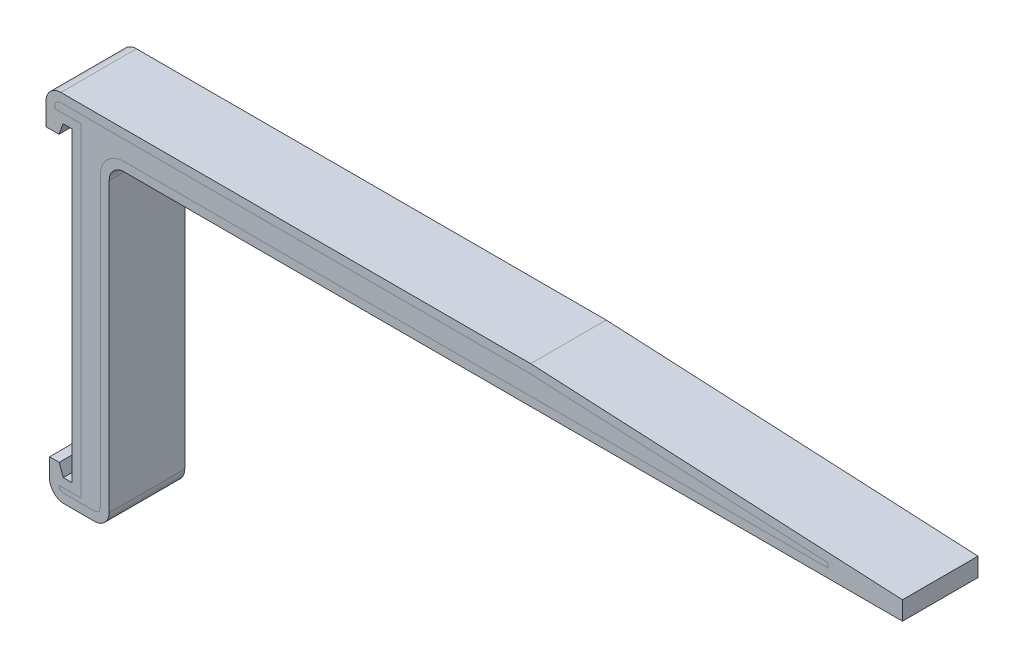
ISO-10303-21;
HEADER;
FILE_DESCRIPTION(('STEP AP214'),'2;1');
FILE_NAME('part.step','',(''),(''),'','','');
FILE_SCHEMA(('AUTOMOTIVE_DESIGN { 1 0 10303 214 1 1 1 1 }'));
ENDSEC;
DATA;
#1=APPLICATION_CONTEXT('core data for automotive mechanical design processes');
#2=APPLICATION_PROTOCOL_DEFINITION('international standard','automotive_design',2000,#1);
#3=PRODUCT_CONTEXT('',#1,'mechanical');
#4=PRODUCT('Part','Part','',(#3));
#5=PRODUCT_RELATED_PRODUCT_CATEGORY('part','',(#4));
#6=PRODUCT_DEFINITION_FORMATION('','',#4);
#7=PRODUCT_DEFINITION_CONTEXT('part definition',#1,'design');
#8=PRODUCT_DEFINITION('design','',#6,#7);
#9=PRODUCT_DEFINITION_SHAPE('','',#8);
#10=(LENGTH_UNIT() NAMED_UNIT(*) SI_UNIT(.MILLI.,.METRE.));
#11=(NAMED_UNIT(*) PLANE_ANGLE_UNIT() SI_UNIT($,.RADIAN.));
#12=(NAMED_UNIT(*) SI_UNIT($,.STERADIAN.) SOLID_ANGLE_UNIT());
#13=UNCERTAINTY_MEASURE_WITH_UNIT(LENGTH_MEASURE(1.E-05),#10,'distance_accuracy_value','');
#14=(GEOMETRIC_REPRESENTATION_CONTEXT(3) GLOBAL_UNCERTAINTY_ASSIGNED_CONTEXT((#13)) GLOBAL_UNIT_ASSIGNED_CONTEXT((#10,
#11,#12)) REPRESENTATION_CONTEXT('',''));
#15=CARTESIAN_POINT('',(0.,0.,0.));
#16=DIRECTION('',(0.,0.,1.));
#17=DIRECTION('',(1.,0.,0.));
#18=AXIS2_PLACEMENT_3D('',#15,#16,#17);
#19=CARTESIAN_POINT('',(0.,0.,-50.8));
#20=DIRECTION('',(0.,0.,1.));
#21=DIRECTION('',(1.,0.,0.));
#22=AXIS2_PLACEMENT_3D('',#19,#20,#21);
#23=PLANE('',#22);
#24=DIRECTION('',(0.,-1.,0.));
#25=VECTOR('',#24,1.);
#26=CARTESIAN_POINT('',(99.55,-8062.375,-50.8));
#27=LINE('',#26,#25);
#28=CARTESIAN_POINT('',(99.55,-8032.375,-50.8));
#29=VERTEX_POINT('',#28);
#30=CARTESIAN_POINT('',(99.55,-8062.375,-50.8));
#31=VERTEX_POINT('',#30);
#32=EDGE_CURVE('E404',#29,#31,#27,.T.);
#33=ORIENTED_EDGE('',*,*,#32,.F.);
#34=CARTESIAN_POINT('',(119.55,-8032.375,-50.8));
#35=DIRECTION('',(0.,0.,1.));
#36=DIRECTION('',(1.,0.,0.));
#37=AXIS2_PLACEMENT_3D('',#34,#35,#36);
#38=CIRCLE('',#37,20.);
#39=CARTESIAN_POINT('',(119.55,-8012.375,-50.8));
#40=VERTEX_POINT('',#39);
#41=EDGE_CURVE('E527',#29,#40,#38,.F.);
#42=ORIENTED_EDGE('',*,*,#41,.T.);
#43=DIRECTION('',(-1.,0.,0.));
#44=VECTOR('',#43,1.);
#45=CARTESIAN_POINT('',(99.55,-8012.375,-50.8));
#46=LINE('',#45,#44);
#47=CARTESIAN_POINT('',(751.35,-8012.375,-50.8));
#48=VERTEX_POINT('',#47);
#49=EDGE_CURVE('E401',#48,#40,#46,.T.);
#50=ORIENTED_EDGE('',*,*,#49,.F.);
#51=DIRECTION('',(-0.998752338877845,0.0499376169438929,0.));
#52=VECTOR('',#51,1.);
#53=CARTESIAN_POINT('',(1251.35,-8037.375,-50.8));
#54=LINE('',#53,#52);
#55=CARTESIAN_POINT('',(1251.35,-8037.375,-50.8));
#56=VERTEX_POINT('',#55);
#57=EDGE_CURVE('E398',#56,#48,#54,.T.);
#58=ORIENTED_EDGE('',*,*,#57,.F.);
#59=DIRECTION('',(0.,1.,0.));
#60=VECTOR('',#59,1.);
#61=CARTESIAN_POINT('',(1251.35,-8062.375,-50.8));
#62=LINE('',#61,#60);
#63=CARTESIAN_POINT('',(1251.35,-8062.375,-50.8));
#64=VERTEX_POINT('',#63);
#65=EDGE_CURVE('E393',#64,#56,#62,.T.);
#66=ORIENTED_EDGE('',*,*,#65,.F.);
#67=DIRECTION('',(1.,0.,0.));
#68=VECTOR('',#67,1.);
#69=CARTESIAN_POINT('',(184.55,-8062.375,-50.8));
#70=LINE('',#69,#68);
#71=CARTESIAN_POINT('',(1098.95,-8062.375,-50.8));
#72=VERTEX_POINT('',#71);
#73=EDGE_CURVE('E390',#72,#64,#70,.T.);
#74=ORIENTED_EDGE('',*,*,#73,.F.);
#75=CARTESIAN_POINT('',(794.15,-8062.375,-50.8));
#76=VERTEX_POINT('',#75);
#77=EDGE_CURVE('E395',#76,#72,#70,.T.);
#78=ORIENTED_EDGE('',*,*,#77,.F.);
#79=CARTESIAN_POINT('',(489.35,-8062.375,-50.8));
#80=VERTEX_POINT('',#79);
#81=EDGE_CURVE('E394',#80,#76,#70,.T.);
#82=ORIENTED_EDGE('',*,*,#81,.F.);
#83=CARTESIAN_POINT('',(204.55,-8062.375,-50.8));
#84=VERTEX_POINT('',#83);
#85=EDGE_CURVE('E391',#84,#80,#70,.T.);
#86=ORIENTED_EDGE('',*,*,#85,.F.);
#87=CARTESIAN_POINT('',(204.55,-8082.375,-50.8));
#88=DIRECTION('',(0.,0.,1.));
#89=DIRECTION('',(1.,0.,0.));
#90=AXIS2_PLACEMENT_3D('',#87,#88,#89);
#91=CIRCLE('',#90,20.);
#92=CARTESIAN_POINT('',(184.55,-8082.375,-50.8));
#93=VERTEX_POINT('',#92);
#94=EDGE_CURVE('E539',#84,#93,#91,.T.);
#95=ORIENTED_EDGE('',*,*,#94,.T.);
#96=DIRECTION('',(0.,1.,0.));
#97=VECTOR('',#96,1.);
#98=CARTESIAN_POINT('',(184.55,-8489.375,-50.8));
#99=LINE('',#98,#97);
#100=CARTESIAN_POINT('',(184.55,-8469.375,-50.8));
#101=VERTEX_POINT('',#100);
#102=EDGE_CURVE('E387',#101,#93,#99,.T.);
#103=ORIENTED_EDGE('',*,*,#102,.F.);
#104=CARTESIAN_POINT('',(164.55,-8469.375,-50.8));
#105=DIRECTION('',(0.,0.,1.));
#106=DIRECTION('',(1.,0.,0.));
#107=AXIS2_PLACEMENT_3D('',#104,#105,#106);
#108=CIRCLE('',#107,20.);
#109=CARTESIAN_POINT('',(164.55,-8489.375,-50.8));
#110=VERTEX_POINT('',#109);
#111=EDGE_CURVE('E523',#101,#110,#108,.F.);
#112=ORIENTED_EDGE('',*,*,#111,.T.);
#113=DIRECTION('',(1.,0.,0.));
#114=VECTOR('',#113,1.);
#115=CARTESIAN_POINT('',(104.3,-8489.375,-50.8));
#116=LINE('',#115,#114);
#117=CARTESIAN_POINT('',(124.3,-8489.375,-50.8));
#118=VERTEX_POINT('',#117);
#119=EDGE_CURVE('E383',#118,#110,#116,.T.);
#120=ORIENTED_EDGE('',*,*,#119,.F.);
#121=CARTESIAN_POINT('',(124.3,-8469.375,-50.8));
#122=DIRECTION('',(0.,0.,1.));
#123=DIRECTION('',(1.,0.,0.));
#124=AXIS2_PLACEMENT_3D('',#121,#122,#123);
#125=CIRCLE('',#124,20.);
#126=CARTESIAN_POINT('',(104.3,-8469.375,-50.8));
#127=VERTEX_POINT('',#126);
#128=EDGE_CURVE('E525',#118,#127,#125,.F.);
#129=ORIENTED_EDGE('',*,*,#128,.T.);
#130=DIRECTION('',(0.,-1.,0.));
#131=VECTOR('',#130,1.);
#132=CARTESIAN_POINT('',(104.3,-8444.375,-50.8));
#133=LINE('',#132,#131);
#134=CARTESIAN_POINT('',(104.3,-8444.375,-50.8));
#135=VERTEX_POINT('',#134);
#136=EDGE_CURVE('E380',#135,#127,#133,.T.);
#137=ORIENTED_EDGE('',*,*,#136,.F.);
#138=DIRECTION('',(-1.,0.,0.));
#139=VECTOR('',#138,1.);
#140=CARTESIAN_POINT('',(117.3,-8444.375,-50.8));
#141=LINE('',#140,#139);
#142=CARTESIAN_POINT('',(117.3,-8444.375,-50.8));
#143=VERTEX_POINT('',#142);
#144=EDGE_CURVE('E424',#143,#135,#141,.T.);
#145=ORIENTED_EDGE('',*,*,#144,.F.);
#146=DIRECTION('',(-0.34202014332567,0.939692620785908,0.));
#147=VECTOR('',#146,1.);
#148=CARTESIAN_POINT('',(122.759553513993,-8459.375,-50.8));
#149=LINE('',#148,#147);
#150=CARTESIAN_POINT('',(122.759553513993,-8459.375,-50.8));
#151=VERTEX_POINT('',#150);
#152=EDGE_CURVE('E421',#151,#143,#149,.T.);
#153=ORIENTED_EDGE('',*,*,#152,.F.);
#154=DIRECTION('',(-1.,0.,0.));
#155=VECTOR('',#154,1.);
#156=CARTESIAN_POINT('',(134.55,-8459.375,-50.8));
#157=LINE('',#156,#155);
#158=CARTESIAN_POINT('',(134.55,-8459.375,-50.8));
#159=VERTEX_POINT('',#158);
#160=EDGE_CURVE('E418',#159,#151,#157,.T.);
#161=ORIENTED_EDGE('',*,*,#160,.F.);
#162=DIRECTION('',(0.,-1.,0.));
#163=VECTOR('',#162,1.);
#164=CARTESIAN_POINT('',(134.55,-8459.375,-50.8));
#165=LINE('',#164,#163);
#166=CARTESIAN_POINT('',(134.55,-8337.96903939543,-50.8));
#167=VERTEX_POINT('',#166);
#168=EDGE_CURVE('E349',#167,#159,#165,.T.);
#169=ORIENTED_EDGE('',*,*,#168,.F.);
#170=CARTESIAN_POINT('',(134.55,-8157.34055453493,-50.8));
#171=VERTEX_POINT('',#170);
#172=EDGE_CURVE('E419',#171,#167,#165,.T.);
#173=ORIENTED_EDGE('',*,*,#172,.F.);
#174=CARTESIAN_POINT('',(134.55,-8047.375,-50.8));
#175=VERTEX_POINT('',#174);
#176=EDGE_CURVE('E415',#175,#171,#165,.T.);
#177=ORIENTED_EDGE('',*,*,#176,.F.);
#178=DIRECTION('',(1.,0.,0.));
#179=VECTOR('',#178,1.);
#180=CARTESIAN_POINT('',(122.509553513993,-8047.375,-50.8));
#181=LINE('',#180,#179);
#182=CARTESIAN_POINT('',(122.509553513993,-8047.375,-50.8));
#183=VERTEX_POINT('',#182);
#184=EDGE_CURVE('E412',#183,#175,#181,.T.);
#185=ORIENTED_EDGE('',*,*,#184,.F.);
#186=DIRECTION('',(0.34202014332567,0.939692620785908,0.));
#187=VECTOR('',#186,1.);
#188=CARTESIAN_POINT('',(117.05,-8062.375,-50.8));
#189=LINE('',#188,#187);
#190=CARTESIAN_POINT('',(117.05,-8062.375,-50.8));
#191=VERTEX_POINT('',#190);
#192=EDGE_CURVE('E409',#191,#183,#189,.T.);
#193=ORIENTED_EDGE('',*,*,#192,.F.);
#194=DIRECTION('',(1.,0.,0.));
#195=VECTOR('',#194,1.);
#196=CARTESIAN_POINT('',(117.05,-8062.375,-50.8));
#197=LINE('',#196,#195);
#198=EDGE_CURVE('E406',#31,#191,#197,.T.);
#199=ORIENTED_EDGE('',*,*,#198,.F.);
#200=EDGE_LOOP('',(#33,#42,#50,#58,#66,#74,#78,#82,#86,#95,#103,#112,#120,#129,#137,#145,#153,
#161,#169,#173,#177,#185,#193,#199));
#201=FACE_BOUND('',#200,.T.);
#202=DIRECTION('',(-1.,0.,0.));
#203=VECTOR('',#202,1.);
#204=CARTESIAN_POINT('',(0.,-8050.375,-50.8));
#205=LINE('',#204,#203);
#206=CARTESIAN_POINT('',(1151.05018726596,-8050.375,-50.8));
#207=VERTEX_POINT('',#206);
#208=CARTESIAN_POINT('',(1098.95,-8050.375,-50.8));
#209=VERTEX_POINT('',#208);
#210=EDGE_CURVE('E11',#207,#209,#205,.T.);
#211=ORIENTED_EDGE('',*,*,#210,.F.);
#212=DIRECTION('',(5.73615229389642E-12,-1.,0.));
#213=VECTOR('',#212,1.);
#214=CARTESIAN_POINT('',(1151.05018721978,6.60259917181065E-09,-50.8));
#215=LINE('',#214,#213);
#216=CARTESIAN_POINT('',(1151.05018726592,-8044.375,-50.8));
#217=VERTEX_POINT('',#216);
#218=EDGE_CURVE('E49',#217,#207,#215,.T.);
#219=ORIENTED_EDGE('',*,*,#218,.F.);
#220=DIRECTION('',(0.998752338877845,-0.0499376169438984,0.));
#221=VECTOR('',#220,1.);
#222=CARTESIAN_POINT('',(-398.345261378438,-7966.90522756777,-50.8));
#223=LINE('',#222,#221);
#224=CARTESIAN_POINT('',(751.050187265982,-8024.375,-50.8));
#225=VERTEX_POINT('',#224);
#226=EDGE_CURVE('E628',#225,#217,#223,.T.);
#227=ORIENTED_EDGE('',*,*,#226,.F.);
#228=DIRECTION('',(1.,0.,0.));
#229=VECTOR('',#228,1.);
#230=CARTESIAN_POINT('',(0.,-8024.375,-50.8));
#231=LINE('',#230,#229);
#232=CARTESIAN_POINT('',(119.55,-8024.375,-50.8));
#233=VERTEX_POINT('',#232);
#234=EDGE_CURVE('E631',#233,#225,#231,.T.);
#235=ORIENTED_EDGE('',*,*,#234,.F.);
#236=CARTESIAN_POINT('',(119.55,-8032.375,-50.8));
#237=DIRECTION('',(0.,0.,1.));
#238=DIRECTION('',(1.,0.,0.));
#239=AXIS2_PLACEMENT_3D('',#236,#237,#238);
#240=CIRCLE('',#239,7.99999999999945);
#241=CARTESIAN_POINT('',(111.55,-8032.375,-50.8));
#242=VERTEX_POINT('',#241);
#243=EDGE_CURVE('E635',#242,#233,#240,.F.);
#244=ORIENTED_EDGE('',*,*,#243,.F.);
#245=DIRECTION('',(0.,1.,0.));
#246=VECTOR('',#245,1.);
#247=CARTESIAN_POINT('',(111.55,0.,-50.8));
#248=LINE('',#247,#246);
#249=CARTESIAN_POINT('',(111.55,-8035.375,-50.8));
#250=VERTEX_POINT('',#249);
#251=EDGE_CURVE('E639',#250,#242,#248,.T.);
#252=ORIENTED_EDGE('',*,*,#251,.F.);
#253=DIRECTION('',(-1.,0.,0.));
#254=VECTOR('',#253,1.);
#255=CARTESIAN_POINT('',(0.,-8035.375,-50.8));
#256=LINE('',#255,#254);
#257=CARTESIAN_POINT('',(114.107063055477,-8035.375,-50.8));
#258=VERTEX_POINT('',#257);
#259=EDGE_CURVE('E643',#258,#250,#256,.T.);
#260=ORIENTED_EDGE('',*,*,#259,.F.);
#261=DIRECTION('',(-1.,0.,0.));
#262=VECTOR('',#261,1.);
#263=CARTESIAN_POINT('',(0.,-8035.375,-50.8));
#264=LINE('',#263,#262);
#265=CARTESIAN_POINT('',(146.55,-8035.375,-50.8));
#266=VERTEX_POINT('',#265);
#267=EDGE_CURVE('E647',#266,#258,#264,.T.);
#268=ORIENTED_EDGE('',*,*,#267,.F.);
#269=DIRECTION('',(0.,1.,0.));
#270=VECTOR('',#269,1.);
#271=CARTESIAN_POINT('',(146.55,0.,-50.8));
#272=LINE('',#271,#270);
#273=CARTESIAN_POINT('',(146.55,-8157.34055453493,-50.8));
#274=VERTEX_POINT('',#273);
#275=EDGE_CURVE('E651',#274,#266,#272,.T.);
#276=ORIENTED_EDGE('',*,*,#275,.F.);
#277=DIRECTION('',(0.,1.,0.));
#278=VECTOR('',#277,1.);
#279=CARTESIAN_POINT('',(146.55,0.,-50.8));
#280=LINE('',#279,#278);
#281=CARTESIAN_POINT('',(146.55,-8337.96903939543,-50.8));
#282=VERTEX_POINT('',#281);
#283=EDGE_CURVE('E655',#282,#274,#280,.T.);
#284=ORIENTED_EDGE('',*,*,#283,.F.);
#285=DIRECTION('',(0.,1.,0.));
#286=VECTOR('',#285,1.);
#287=CARTESIAN_POINT('',(146.55,0.,-50.8));
#288=LINE('',#287,#286);
#289=CARTESIAN_POINT('',(146.55,-8471.375,-50.8));
#290=VERTEX_POINT('',#289);
#291=EDGE_CURVE('E659',#290,#282,#288,.T.);
#292=ORIENTED_EDGE('',*,*,#291,.F.);
#293=DIRECTION('',(1.,0.,0.));
#294=VECTOR('',#293,1.);
#295=CARTESIAN_POINT('',(0.,-8471.375,-50.8));
#296=LINE('',#295,#294);
#297=CARTESIAN_POINT('',(116.554033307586,-8471.375,-50.8));
#298=VERTEX_POINT('',#297);
#299=EDGE_CURVE('E663',#298,#290,#296,.T.);
#300=ORIENTED_EDGE('',*,*,#299,.F.);
#301=CARTESIAN_POINT('',(124.3,-8469.375,-50.8));
#302=DIRECTION('',(0.,0.,1.));
#303=DIRECTION('',(1.,0.,0.));
#304=AXIS2_PLACEMENT_3D('',#301,#302,#303);
#305=CIRCLE('',#304,7.99999999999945);
#306=CARTESIAN_POINT('',(124.3,-8477.375,-50.8));
#307=VERTEX_POINT('',#306);
#308=EDGE_CURVE('E667',#307,#298,#305,.F.);
#309=ORIENTED_EDGE('',*,*,#308,.F.);
#310=DIRECTION('',(-1.,0.,0.));
#311=VECTOR('',#310,1.);
#312=CARTESIAN_POINT('',(0.,-8477.375,-50.8));
#313=LINE('',#312,#311);
#314=CARTESIAN_POINT('',(164.55,-8477.375,-50.8));
#315=VERTEX_POINT('',#314);
#316=EDGE_CURVE('E671',#315,#307,#313,.T.);
#317=ORIENTED_EDGE('',*,*,#316,.F.);
#318=CARTESIAN_POINT('',(164.55,-8469.375,-50.8));
#319=DIRECTION('',(0.,0.,1.));
#320=DIRECTION('',(1.,0.,0.));
#321=AXIS2_PLACEMENT_3D('',#318,#319,#320);
#322=CIRCLE('',#321,7.99999999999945);
#323=CARTESIAN_POINT('',(172.55,-8469.375,-50.8));
#324=VERTEX_POINT('',#323);
#325=EDGE_CURVE('E675',#324,#315,#322,.F.);
#326=ORIENTED_EDGE('',*,*,#325,.F.);
#327=DIRECTION('',(0.,-1.,0.));
#328=VECTOR('',#327,1.);
#329=CARTESIAN_POINT('',(172.550000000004,0.,-50.8));
#330=LINE('',#329,#328);
#331=CARTESIAN_POINT('',(172.55,-8082.375,-50.8));
#332=VERTEX_POINT('',#331);
#333=EDGE_CURVE('E679',#332,#324,#330,.T.);
#334=ORIENTED_EDGE('',*,*,#333,.F.);
#335=CARTESIAN_POINT('',(204.55,-8082.375,-50.8));
#336=DIRECTION('',(0.,0.,1.));
#337=DIRECTION('',(1.,0.,0.));
#338=AXIS2_PLACEMENT_3D('',#335,#336,#337);
#339=CIRCLE('',#338,32.);
#340=CARTESIAN_POINT('',(204.55,-8050.375,-50.8));
#341=VERTEX_POINT('',#340);
#342=EDGE_CURVE('E683',#341,#332,#339,.T.);
#343=ORIENTED_EDGE('',*,*,#342,.F.);
#344=DIRECTION('',(-1.,0.,0.));
#345=VECTOR('',#344,1.);
#346=CARTESIAN_POINT('',(0.,-8050.375,-50.8));
#347=LINE('',#346,#345);
#348=CARTESIAN_POINT('',(489.35,-8050.375,-50.8));
#349=VERTEX_POINT('',#348);
#350=EDGE_CURVE('E687',#349,#341,#347,.T.);
#351=ORIENTED_EDGE('',*,*,#350,.F.);
#352=DIRECTION('',(-1.,0.,0.));
#353=VECTOR('',#352,1.);
#354=CARTESIAN_POINT('',(0.,-8050.375,-50.8));
#355=LINE('',#354,#353);
#356=CARTESIAN_POINT('',(794.15,-8050.375,-50.8));
#357=VERTEX_POINT('',#356);
#358=EDGE_CURVE('E690',#357,#349,#355,.T.);
#359=ORIENTED_EDGE('',*,*,#358,.F.);
#360=DIRECTION('',(-1.,0.,0.));
#361=VECTOR('',#360,1.);
#362=CARTESIAN_POINT('',(0.,-8050.375,-50.8));
#363=LINE('',#362,#361);
#364=EDGE_CURVE('E43',#209,#357,#363,.T.);
#365=ORIENTED_EDGE('',*,*,#364,.F.);
#366=EDGE_LOOP('',(#211,#219,#227,#235,#244,#252,#260,#268,#276,#284,#292,#300,#309,#317,#326,
#334,#343,#351,#359,#365));
#367=FACE_BOUND('',#366,.T.);
#368=ADVANCED_FACE('F39',(#201,#367),#23,.F.);
#369=CARTESIAN_POINT('',(0.,0.,50.8));
#370=DIRECTION('',(0.,0.,1.));
#371=DIRECTION('',(1.,0.,0.));
#372=AXIS2_PLACEMENT_3D('',#369,#370,#371);
#373=PLANE('',#372);
#374=DIRECTION('',(-1.,0.,0.));
#375=VECTOR('',#374,1.);
#376=CARTESIAN_POINT('',(99.55,-8012.375,50.8));
#377=LINE('',#376,#375);
#378=CARTESIAN_POINT('',(751.35,-8012.375,50.8));
#379=VERTEX_POINT('',#378);
#380=CARTESIAN_POINT('',(119.55,-8012.375,50.8));
#381=VERTEX_POINT('',#380);
#382=EDGE_CURVE('E447',#379,#381,#377,.T.);
#383=ORIENTED_EDGE('',*,*,#382,.T.);
#384=CARTESIAN_POINT('',(119.55,-8032.375,50.8));
#385=DIRECTION('',(0.,0.,1.));
#386=DIRECTION('',(1.,0.,0.));
#387=AXIS2_PLACEMENT_3D('',#384,#385,#386);
#388=CIRCLE('',#387,20.);
#389=CARTESIAN_POINT('',(99.55,-8032.375,50.8));
#390=VERTEX_POINT('',#389);
#391=EDGE_CURVE('E519',#381,#390,#388,.T.);
#392=ORIENTED_EDGE('',*,*,#391,.T.);
#393=DIRECTION('',(0.,-1.,0.));
#394=VECTOR('',#393,1.);
#395=CARTESIAN_POINT('',(99.55,-8062.375,50.8));
#396=LINE('',#395,#394);
#397=CARTESIAN_POINT('',(99.55,-8062.375,50.8));
#398=VERTEX_POINT('',#397);
#399=EDGE_CURVE('E450',#390,#398,#396,.T.);
#400=ORIENTED_EDGE('',*,*,#399,.T.);
#401=DIRECTION('',(1.,0.,0.));
#402=VECTOR('',#401,1.);
#403=CARTESIAN_POINT('',(117.05,-8062.375,50.8));
#404=LINE('',#403,#402);
#405=CARTESIAN_POINT('',(117.05,-8062.375,50.8));
#406=VERTEX_POINT('',#405);
#407=EDGE_CURVE('E452',#398,#406,#404,.T.);
#408=ORIENTED_EDGE('',*,*,#407,.T.);
#409=DIRECTION('',(0.34202014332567,0.939692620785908,0.));
#410=VECTOR('',#409,1.);
#411=CARTESIAN_POINT('',(117.05,-8062.375,50.8));
#412=LINE('',#411,#410);
#413=CARTESIAN_POINT('',(122.509553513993,-8047.375,50.8));
#414=VERTEX_POINT('',#413);
#415=EDGE_CURVE('E455',#406,#414,#412,.T.);
#416=ORIENTED_EDGE('',*,*,#415,.T.);
#417=DIRECTION('',(1.,0.,0.));
#418=VECTOR('',#417,1.);
#419=CARTESIAN_POINT('',(122.509553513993,-8047.375,50.8));
#420=LINE('',#419,#418);
#421=CARTESIAN_POINT('',(134.55,-8047.375,50.8));
#422=VERTEX_POINT('',#421);
#423=EDGE_CURVE('E458',#414,#422,#420,.T.);
#424=ORIENTED_EDGE('',*,*,#423,.T.);
#425=DIRECTION('',(0.,-1.,0.));
#426=VECTOR('',#425,1.);
#427=CARTESIAN_POINT('',(134.55,-8459.375,50.8));
#428=LINE('',#427,#426);
#429=CARTESIAN_POINT('',(134.55,-8157.34055453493,50.8));
#430=VERTEX_POINT('',#429);
#431=EDGE_CURVE('E462',#422,#430,#428,.T.);
#432=ORIENTED_EDGE('',*,*,#431,.T.);
#433=CARTESIAN_POINT('',(134.55,-8337.96903939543,50.8));
#434=VERTEX_POINT('',#433);
#435=EDGE_CURVE('E466',#430,#434,#428,.T.);
#436=ORIENTED_EDGE('',*,*,#435,.T.);
#437=CARTESIAN_POINT('',(134.55,-8459.375,50.8));
#438=VERTEX_POINT('',#437);
#439=EDGE_CURVE('E461',#434,#438,#428,.T.);
#440=ORIENTED_EDGE('',*,*,#439,.T.);
#441=DIRECTION('',(-1.,0.,0.));
#442=VECTOR('',#441,1.);
#443=CARTESIAN_POINT('',(134.55,-8459.375,50.8));
#444=LINE('',#443,#442);
#445=CARTESIAN_POINT('',(122.759553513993,-8459.375,50.8));
#446=VERTEX_POINT('',#445);
#447=EDGE_CURVE('E465',#438,#446,#444,.T.);
#448=ORIENTED_EDGE('',*,*,#447,.T.);
#449=DIRECTION('',(-0.34202014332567,0.939692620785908,0.));
#450=VECTOR('',#449,1.);
#451=CARTESIAN_POINT('',(122.759553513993,-8459.375,50.8));
#452=LINE('',#451,#450);
#453=CARTESIAN_POINT('',(117.3,-8444.375,50.8));
#454=VERTEX_POINT('',#453);
#455=EDGE_CURVE('E469',#446,#454,#452,.T.);
#456=ORIENTED_EDGE('',*,*,#455,.T.);
#457=DIRECTION('',(-1.,0.,0.));
#458=VECTOR('',#457,1.);
#459=CARTESIAN_POINT('',(117.3,-8444.375,50.8));
#460=LINE('',#459,#458);
#461=CARTESIAN_POINT('',(104.3,-8444.375,50.8));
#462=VERTEX_POINT('',#461);
#463=EDGE_CURVE('E384',#454,#462,#460,.T.);
#464=ORIENTED_EDGE('',*,*,#463,.T.);
#465=DIRECTION('',(0.,-1.,0.));
#466=VECTOR('',#465,1.);
#467=CARTESIAN_POINT('',(104.3,-8444.375,50.8));
#468=LINE('',#467,#466);
#469=CARTESIAN_POINT('',(104.3,-8469.375,50.8));
#470=VERTEX_POINT('',#469);
#471=EDGE_CURVE('E379',#462,#470,#468,.T.);
#472=ORIENTED_EDGE('',*,*,#471,.T.);
#473=CARTESIAN_POINT('',(124.3,-8469.375,50.8));
#474=DIRECTION('',(0.,0.,1.));
#475=DIRECTION('',(1.,0.,0.));
#476=AXIS2_PLACEMENT_3D('',#473,#474,#475);
#477=CIRCLE('',#476,20.);
#478=CARTESIAN_POINT('',(124.3,-8489.375,50.8));
#479=VERTEX_POINT('',#478);
#480=EDGE_CURVE('E517',#470,#479,#477,.T.);
#481=ORIENTED_EDGE('',*,*,#480,.T.);
#482=DIRECTION('',(1.,0.,0.));
#483=VECTOR('',#482,1.);
#484=CARTESIAN_POINT('',(104.3,-8489.375,50.8));
#485=LINE('',#484,#483);
#486=CARTESIAN_POINT('',(164.55,-8489.375,50.8));
#487=VERTEX_POINT('',#486);
#488=EDGE_CURVE('E430',#479,#487,#485,.T.);
#489=ORIENTED_EDGE('',*,*,#488,.T.);
#490=CARTESIAN_POINT('',(164.55,-8469.375,50.8));
#491=DIRECTION('',(0.,0.,1.));
#492=DIRECTION('',(1.,0.,0.));
#493=AXIS2_PLACEMENT_3D('',#490,#491,#492);
#494=CIRCLE('',#493,20.);
#495=CARTESIAN_POINT('',(184.55,-8469.375,50.8));
#496=VERTEX_POINT('',#495);
#497=EDGE_CURVE('E515',#487,#496,#494,.T.);
#498=ORIENTED_EDGE('',*,*,#497,.T.);
#499=DIRECTION('',(0.,1.,0.));
#500=VECTOR('',#499,1.);
#501=CARTESIAN_POINT('',(184.55,-8489.375,50.8));
#502=LINE('',#501,#500);
#503=CARTESIAN_POINT('',(184.55,-8082.375,50.8));
#504=VERTEX_POINT('',#503);
#505=EDGE_CURVE('E433',#496,#504,#502,.T.);
#506=ORIENTED_EDGE('',*,*,#505,.T.);
#507=CARTESIAN_POINT('',(204.55,-8082.375,50.8));
#508=DIRECTION('',(0.,0.,1.));
#509=DIRECTION('',(1.,0.,0.));
#510=AXIS2_PLACEMENT_3D('',#507,#508,#509);
#511=CIRCLE('',#510,20.);
#512=CARTESIAN_POINT('',(204.55,-8062.375,50.8));
#513=VERTEX_POINT('',#512);
#514=EDGE_CURVE('E537',#504,#513,#511,.F.);
#515=ORIENTED_EDGE('',*,*,#514,.T.);
#516=DIRECTION('',(1.,0.,0.));
#517=VECTOR('',#516,1.);
#518=CARTESIAN_POINT('',(184.55,-8062.375,50.8));
#519=LINE('',#518,#517);
#520=CARTESIAN_POINT('',(489.35,-8062.375,50.8));
#521=VERTEX_POINT('',#520);
#522=EDGE_CURVE('E437',#513,#521,#519,.T.);
#523=ORIENTED_EDGE('',*,*,#522,.T.);
#524=CARTESIAN_POINT('',(794.15,-8062.375,50.8));
#525=VERTEX_POINT('',#524);
#526=EDGE_CURVE('E440',#521,#525,#519,.T.);
#527=ORIENTED_EDGE('',*,*,#526,.T.);
#528=CARTESIAN_POINT('',(1098.95,-8062.375,50.8));
#529=VERTEX_POINT('',#528);
#530=EDGE_CURVE('E441',#525,#529,#519,.T.);
#531=ORIENTED_EDGE('',*,*,#530,.T.);
#532=CARTESIAN_POINT('',(1251.35,-8062.375,50.8));
#533=VERTEX_POINT('',#532);
#534=EDGE_CURVE('E436',#529,#533,#519,.T.);
#535=ORIENTED_EDGE('',*,*,#534,.T.);
#536=DIRECTION('',(0.,1.,0.));
#537=VECTOR('',#536,1.);
#538=CARTESIAN_POINT('',(1251.35,-8062.375,50.8));
#539=LINE('',#538,#537);
#540=CARTESIAN_POINT('',(1251.35,-8037.375,50.8));
#541=VERTEX_POINT('',#540);
#542=EDGE_CURVE('E439',#533,#541,#539,.T.);
#543=ORIENTED_EDGE('',*,*,#542,.T.);
#544=DIRECTION('',(-0.998752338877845,0.0499376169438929,0.));
#545=VECTOR('',#544,1.);
#546=CARTESIAN_POINT('',(1251.35,-8037.375,50.8));
#547=LINE('',#546,#545);
#548=EDGE_CURVE('E444',#541,#379,#547,.T.);
#549=ORIENTED_EDGE('',*,*,#548,.T.);
#550=EDGE_LOOP('',(#383,#392,#400,#408,#416,#424,#432,#436,#440,#448,#456,#464,#472,#481,#489,
#498,#506,#515,#523,#527,#531,#535,#543,#549));
#551=FACE_BOUND('',#550,.T.);
#552=DIRECTION('',(5.73615229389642E-12,-1.,0.));
#553=VECTOR('',#552,1.);
#554=CARTESIAN_POINT('',(1151.05018721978,6.60259917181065E-09,50.8));
#555=LINE('',#554,#553);
#556=CARTESIAN_POINT('',(1151.05018726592,-8044.375,50.8));
#557=VERTEX_POINT('',#556);
#558=CARTESIAN_POINT('',(1151.05018726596,-8050.375,50.8));
#559=VERTEX_POINT('',#558);
#560=EDGE_CURVE('E619',#557,#559,#555,.T.);
#561=ORIENTED_EDGE('',*,*,#560,.T.);
#562=DIRECTION('',(-1.,0.,0.));
#563=VECTOR('',#562,1.);
#564=CARTESIAN_POINT('',(0.,-8050.375,50.8));
#565=LINE('',#564,#563);
#566=CARTESIAN_POINT('',(1098.95,-8050.375,50.8));
#567=VERTEX_POINT('',#566);
#568=EDGE_CURVE('E623',#559,#567,#565,.T.);
#569=ORIENTED_EDGE('',*,*,#568,.T.);
#570=DIRECTION('',(-1.,0.,0.));
#571=VECTOR('',#570,1.);
#572=CARTESIAN_POINT('',(0.,-8050.375,50.8));
#573=LINE('',#572,#571);
#574=CARTESIAN_POINT('',(794.15,-8050.375,50.8));
#575=VERTEX_POINT('',#574);
#576=EDGE_CURVE('E547',#567,#575,#573,.T.);
#577=ORIENTED_EDGE('',*,*,#576,.T.);
#578=DIRECTION('',(-1.,0.,0.));
#579=VECTOR('',#578,1.);
#580=CARTESIAN_POINT('',(0.,-8050.375,50.8));
#581=LINE('',#580,#579);
#582=CARTESIAN_POINT('',(489.35,-8050.375,50.8));
#583=VERTEX_POINT('',#582);
#584=EDGE_CURVE('E551',#575,#583,#581,.T.);
#585=ORIENTED_EDGE('',*,*,#584,.T.);
#586=DIRECTION('',(-1.,0.,0.));
#587=VECTOR('',#586,1.);
#588=CARTESIAN_POINT('',(0.,-8050.375,50.8));
#589=LINE('',#588,#587);
#590=CARTESIAN_POINT('',(204.55,-8050.375,50.8));
#591=VERTEX_POINT('',#590);
#592=EDGE_CURVE('E555',#583,#591,#589,.T.);
#593=ORIENTED_EDGE('',*,*,#592,.T.);
#594=CARTESIAN_POINT('',(204.55,-8082.375,50.8));
#595=DIRECTION('',(0.,0.,1.));
#596=DIRECTION('',(1.,0.,0.));
#597=AXIS2_PLACEMENT_3D('',#594,#595,#596);
#598=CIRCLE('',#597,32.);
#599=CARTESIAN_POINT('',(172.55,-8082.375,50.8));
#600=VERTEX_POINT('',#599);
#601=EDGE_CURVE('E559',#591,#600,#598,.T.);
#602=ORIENTED_EDGE('',*,*,#601,.T.);
#603=DIRECTION('',(0.,-1.,0.));
#604=VECTOR('',#603,1.);
#605=CARTESIAN_POINT('',(172.550000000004,0.,50.8));
#606=LINE('',#605,#604);
#607=CARTESIAN_POINT('',(172.55,-8469.375,50.8));
#608=VERTEX_POINT('',#607);
#609=EDGE_CURVE('E563',#600,#608,#606,.T.);
#610=ORIENTED_EDGE('',*,*,#609,.T.);
#611=CARTESIAN_POINT('',(164.55,-8469.375,50.8));
#612=DIRECTION('',(0.,0.,1.));
#613=DIRECTION('',(1.,0.,0.));
#614=AXIS2_PLACEMENT_3D('',#611,#612,#613);
#615=CIRCLE('',#614,7.99999999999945);
#616=CARTESIAN_POINT('',(164.55,-8477.375,50.8));
#617=VERTEX_POINT('',#616);
#618=EDGE_CURVE('E567',#608,#617,#615,.F.);
#619=ORIENTED_EDGE('',*,*,#618,.T.);
#620=DIRECTION('',(-1.,0.,0.));
#621=VECTOR('',#620,1.);
#622=CARTESIAN_POINT('',(0.,-8477.375,50.8));
#623=LINE('',#622,#621);
#624=CARTESIAN_POINT('',(124.3,-8477.375,50.8));
#625=VERTEX_POINT('',#624);
#626=EDGE_CURVE('E571',#617,#625,#623,.T.);
#627=ORIENTED_EDGE('',*,*,#626,.T.);
#628=CARTESIAN_POINT('',(124.3,-8469.375,50.8));
#629=DIRECTION('',(0.,0.,1.));
#630=DIRECTION('',(1.,0.,0.));
#631=AXIS2_PLACEMENT_3D('',#628,#629,#630);
#632=CIRCLE('',#631,7.99999999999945);
#633=CARTESIAN_POINT('',(116.554033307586,-8471.375,50.8));
#634=VERTEX_POINT('',#633);
#635=EDGE_CURVE('E575',#625,#634,#632,.F.);
#636=ORIENTED_EDGE('',*,*,#635,.T.);
#637=DIRECTION('',(1.,0.,0.));
#638=VECTOR('',#637,1.);
#639=CARTESIAN_POINT('',(0.,-8471.375,50.8));
#640=LINE('',#639,#638);
#641=CARTESIAN_POINT('',(146.55,-8471.375,50.8));
#642=VERTEX_POINT('',#641);
#643=EDGE_CURVE('E579',#634,#642,#640,.T.);
#644=ORIENTED_EDGE('',*,*,#643,.T.);
#645=DIRECTION('',(0.,1.,0.));
#646=VECTOR('',#645,1.);
#647=CARTESIAN_POINT('',(146.55,0.,50.8));
#648=LINE('',#647,#646);
#649=CARTESIAN_POINT('',(146.55,-8337.96903939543,50.8));
#650=VERTEX_POINT('',#649);
#651=EDGE_CURVE('E583',#642,#650,#648,.T.);
#652=ORIENTED_EDGE('',*,*,#651,.T.);
#653=DIRECTION('',(0.,1.,0.));
#654=VECTOR('',#653,1.);
#655=CARTESIAN_POINT('',(146.55,0.,50.8));
#656=LINE('',#655,#654);
#657=CARTESIAN_POINT('',(146.55,-8157.34055453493,50.8));
#658=VERTEX_POINT('',#657);
#659=EDGE_CURVE('E587',#650,#658,#656,.T.);
#660=ORIENTED_EDGE('',*,*,#659,.T.);
#661=DIRECTION('',(0.,1.,0.));
#662=VECTOR('',#661,1.);
#663=CARTESIAN_POINT('',(146.55,0.,50.8));
#664=LINE('',#663,#662);
#665=CARTESIAN_POINT('',(146.55,-8035.375,50.8));
#666=VERTEX_POINT('',#665);
#667=EDGE_CURVE('E591',#658,#666,#664,.T.);
#668=ORIENTED_EDGE('',*,*,#667,.T.);
#669=DIRECTION('',(-1.,0.,0.));
#670=VECTOR('',#669,1.);
#671=CARTESIAN_POINT('',(0.,-8035.375,50.8));
#672=LINE('',#671,#670);
#673=CARTESIAN_POINT('',(114.107063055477,-8035.375,50.8));
#674=VERTEX_POINT('',#673);
#675=EDGE_CURVE('E595',#666,#674,#672,.T.);
#676=ORIENTED_EDGE('',*,*,#675,.T.);
#677=DIRECTION('',(-1.,0.,0.));
#678=VECTOR('',#677,1.);
#679=CARTESIAN_POINT('',(0.,-8035.375,50.8));
#680=LINE('',#679,#678);
#681=CARTESIAN_POINT('',(111.55,-8035.375,50.8));
#682=VERTEX_POINT('',#681);
#683=EDGE_CURVE('E599',#674,#682,#680,.T.);
#684=ORIENTED_EDGE('',*,*,#683,.T.);
#685=DIRECTION('',(0.,1.,0.));
#686=VECTOR('',#685,1.);
#687=CARTESIAN_POINT('',(111.55,0.,50.8));
#688=LINE('',#687,#686);
#689=CARTESIAN_POINT('',(111.55,-8032.375,50.8));
#690=VERTEX_POINT('',#689);
#691=EDGE_CURVE('E603',#682,#690,#688,.T.);
#692=ORIENTED_EDGE('',*,*,#691,.T.);
#693=CARTESIAN_POINT('',(119.55,-8032.375,50.8));
#694=DIRECTION('',(0.,0.,1.));
#695=DIRECTION('',(1.,0.,0.));
#696=AXIS2_PLACEMENT_3D('',#693,#694,#695);
#697=CIRCLE('',#696,7.99999999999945);
#698=CARTESIAN_POINT('',(119.55,-8024.375,50.8));
#699=VERTEX_POINT('',#698);
#700=EDGE_CURVE('E607',#690,#699,#697,.F.);
#701=ORIENTED_EDGE('',*,*,#700,.T.);
#702=DIRECTION('',(1.,0.,0.));
#703=VECTOR('',#702,1.);
#704=CARTESIAN_POINT('',(0.,-8024.375,50.8));
#705=LINE('',#704,#703);
#706=CARTESIAN_POINT('',(751.050187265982,-8024.375,50.8));
#707=VERTEX_POINT('',#706);
#708=EDGE_CURVE('E611',#699,#707,#705,.T.);
#709=ORIENTED_EDGE('',*,*,#708,.T.);
#710=DIRECTION('',(0.998752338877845,-0.0499376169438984,0.));
#711=VECTOR('',#710,1.);
#712=CARTESIAN_POINT('',(-398.345261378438,-7966.90522756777,50.8));
#713=LINE('',#712,#711);
#714=EDGE_CURVE('E615',#707,#557,#713,.T.);
#715=ORIENTED_EDGE('',*,*,#714,.T.);
#716=EDGE_LOOP('',(#561,#569,#577,#585,#593,#602,#610,#619,#627,#636,#644,#652,#660,#668,#676,
#684,#692,#701,#709,#715));
#717=FACE_BOUND('',#716,.T.);
#718=ADVANCED_FACE('F702',(#551,#717),#373,.T.);
#719=CARTESIAN_POINT('',(134.55,-8459.375,-50.8));
#720=DIRECTION('',(-1.,0.,0.));
#721=DIRECTION('',(0.,0.,1.));
#722=AXIS2_PLACEMENT_3D('',#719,#720,#721);
#723=PLANE('',#722);
#724=ORIENTED_EDGE('',*,*,#176,.T.);
#725=DIRECTION('',(0.,0.,1.));
#726=VECTOR('',#725,1.);
#727=CARTESIAN_POINT('',(134.55,-8157.34055453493,-50.8));
#728=LINE('',#727,#726);
#729=EDGE_CURVE('E544',#171,#430,#728,.T.);
#730=ORIENTED_EDGE('',*,*,#729,.T.);
#731=ORIENTED_EDGE('',*,*,#431,.F.);
#732=DIRECTION('',(0.,0.,1.));
#733=VECTOR('',#732,1.);
#734=CARTESIAN_POINT('',(134.55,-8047.375,-50.8));
#735=LINE('',#734,#733);
#736=EDGE_CURVE('E480',#175,#422,#735,.T.);
#737=ORIENTED_EDGE('',*,*,#736,.F.);
#738=EDGE_LOOP('',(#724,#730,#731,#737));
#739=FACE_BOUND('',#738,.T.);
#740=ADVANCED_FACE('F708',(#739),#723,.T.);
#741=ORIENTED_EDGE('',*,*,#439,.F.);
#742=DIRECTION('',(0.,0.,-1.));
#743=VECTOR('',#742,1.);
#744=CARTESIAN_POINT('',(134.55,-8337.96903939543,-50.8));
#745=LINE('',#744,#743);
#746=EDGE_CURVE('E541',#434,#167,#745,.T.);
#747=ORIENTED_EDGE('',*,*,#746,.T.);
#748=ORIENTED_EDGE('',*,*,#168,.T.);
#749=DIRECTION('',(0.,0.,1.));
#750=VECTOR('',#749,1.);
#751=CARTESIAN_POINT('',(134.55,-8459.375,-50.8));
#752=LINE('',#751,#750);
#753=CARTESIAN_POINT('',(134.55,-8459.375,-6.5));
#754=VERTEX_POINT('',#753);
#755=EDGE_CURVE('E341',#159,#754,#752,.T.);
#756=ORIENTED_EDGE('',*,*,#755,.T.);
#757=DIRECTION('',(0.,1.,0.));
#758=VECTOR('',#757,1.);
#759=CARTESIAN_POINT('',(134.55,-8459.375,-6.5));
#760=LINE('',#759,#758);
#761=CARTESIAN_POINT('',(134.55,-8451.375,-6.5));
#762=VERTEX_POINT('',#761);
#763=EDGE_CURVE('E346',#754,#762,#760,.T.);
#764=ORIENTED_EDGE('',*,*,#763,.T.);
#765=DIRECTION('',(0.,0.,-1.));
#766=VECTOR('',#765,1.);
#767=CARTESIAN_POINT('',(134.55,-8451.375,6.5));
#768=LINE('',#767,#766);
#769=CARTESIAN_POINT('',(134.55,-8451.375,6.5));
#770=VERTEX_POINT('',#769);
#771=EDGE_CURVE('E376',#770,#762,#768,.T.);
#772=ORIENTED_EDGE('',*,*,#771,.F.);
#773=DIRECTION('',(0.,1.,0.));
#774=VECTOR('',#773,1.);
#775=CARTESIAN_POINT('',(134.55,-8459.375,6.5));
#776=LINE('',#775,#774);
#777=CARTESIAN_POINT('',(134.55,-8459.375,6.5));
#778=VERTEX_POINT('',#777);
#779=EDGE_CURVE('E772',#778,#770,#776,.T.);
#780=ORIENTED_EDGE('',*,*,#779,.F.);
#781=EDGE_CURVE('E354',#778,#438,#752,.T.);
#782=ORIENTED_EDGE('',*,*,#781,.T.);
#783=EDGE_LOOP('',(#741,#747,#748,#756,#764,#772,#780,#782));
#784=FACE_BOUND('',#783,.T.);
#785=ADVANCED_FACE('F344',(#784),#723,.T.);
#786=CARTESIAN_POINT('',(122.759553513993,-8459.375,-50.8));
#787=DIRECTION('',(0.939692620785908,0.34202014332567,0.));
#788=DIRECTION('',(-0.34202014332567,0.939692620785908,0.));
#789=AXIS2_PLACEMENT_3D('',#786,#787,#788);
#790=PLANE('',#789);
#791=DIRECTION('',(0.,0.,1.));
#792=VECTOR('',#791,1.);
#793=CARTESIAN_POINT('',(122.759553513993,-8459.375,-50.8));
#794=LINE('',#793,#792);
#795=CARTESIAN_POINT('',(122.759553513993,-8459.375,6.5));
#796=VERTEX_POINT('',#795);
#797=EDGE_CURVE('E353',#796,#446,#794,.T.);
#798=ORIENTED_EDGE('',*,*,#797,.F.);
#799=DIRECTION('',(0.34202014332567,-0.939692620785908,0.));
#800=VECTOR('',#799,1.);
#801=CARTESIAN_POINT('',(119.847791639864,-8451.375,6.5));
#802=LINE('',#801,#800);
#803=CARTESIAN_POINT('',(119.847791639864,-8451.375,6.5));
#804=VERTEX_POINT('',#803);
#805=EDGE_CURVE('E370',#804,#796,#802,.T.);
#806=ORIENTED_EDGE('',*,*,#805,.F.);
#807=DIRECTION('',(0.,0.,-1.));
#808=VECTOR('',#807,1.);
#809=CARTESIAN_POINT('',(119.847791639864,-8451.375,6.5));
#810=LINE('',#809,#808);
#811=CARTESIAN_POINT('',(119.847791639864,-8451.375,-6.5));
#812=VERTEX_POINT('',#811);
#813=EDGE_CURVE('E374',#804,#812,#810,.T.);
#814=ORIENTED_EDGE('',*,*,#813,.T.);
#815=DIRECTION('',(0.34202014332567,-0.939692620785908,0.));
#816=VECTOR('',#815,1.);
#817=CARTESIAN_POINT('',(119.847791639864,-8451.375,-6.5));
#818=LINE('',#817,#816);
#819=CARTESIAN_POINT('',(122.759553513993,-8459.375,-6.5));
#820=VERTEX_POINT('',#819);
#821=EDGE_CURVE('E363',#812,#820,#818,.T.);
#822=ORIENTED_EDGE('',*,*,#821,.T.);
#823=EDGE_CURVE('E360',#151,#820,#794,.T.);
#824=ORIENTED_EDGE('',*,*,#823,.F.);
#825=ORIENTED_EDGE('',*,*,#152,.T.);
#826=DIRECTION('',(0.,0.,1.));
#827=VECTOR('',#826,1.);
#828=CARTESIAN_POINT('',(117.3,-8444.375,-50.8));
#829=LINE('',#828,#827);
#830=EDGE_CURVE('E477',#143,#454,#829,.T.);
#831=ORIENTED_EDGE('',*,*,#830,.T.);
#832=ORIENTED_EDGE('',*,*,#455,.F.);
#833=EDGE_LOOP('',(#798,#806,#814,#822,#824,#825,#831,#832));
#834=FACE_BOUND('',#833,.T.);
#835=ADVANCED_FACE('F766',(#834),#790,.T.);
#836=CARTESIAN_POINT('',(134.55,-8459.375,-50.8));
#837=DIRECTION('',(0.,1.,0.));
#838=DIRECTION('',(0.,0.,1.));
#839=AXIS2_PLACEMENT_3D('',#836,#837,#838);
#840=PLANE('',#839);
#841=ORIENTED_EDGE('',*,*,#781,.F.);
#842=DIRECTION('',(1.,0.,0.));
#843=VECTOR('',#842,1.);
#844=CARTESIAN_POINT('',(134.55,-8459.375,6.5));
#845=LINE('',#844,#843);
#846=EDGE_CURVE('E775',#796,#778,#845,.T.);
#847=ORIENTED_EDGE('',*,*,#846,.F.);
#848=ORIENTED_EDGE('',*,*,#797,.T.);
#849=ORIENTED_EDGE('',*,*,#447,.F.);
#850=EDGE_LOOP('',(#841,#847,#848,#849));
#851=FACE_BOUND('',#850,.T.);
#852=ADVANCED_FACE('F785',(#851),#840,.T.);
#853=ORIENTED_EDGE('',*,*,#729,.F.);
#854=ORIENTED_EDGE('',*,*,#172,.T.);
#855=ORIENTED_EDGE('',*,*,#746,.F.);
#856=ORIENTED_EDGE('',*,*,#435,.F.);
#857=EDGE_LOOP('',(#853,#854,#855,#856));
#858=FACE_BOUND('',#857,.T.);
#859=ADVANCED_FACE('F830',(#858),#723,.T.);
#860=CARTESIAN_POINT('',(184.55,-8062.375,-50.8));
#861=DIRECTION('',(0.,-1.,0.));
#862=DIRECTION('',(0.,0.,-1.));
#863=AXIS2_PLACEMENT_3D('',#860,#861,#862);
#864=PLANE('',#863);
#865=ORIENTED_EDGE('',*,*,#534,.F.);
#866=DIRECTION('',(0.,0.,-1.));
#867=VECTOR('',#866,1.);
#868=CARTESIAN_POINT('',(1098.95,-8062.375,-50.8));
#869=LINE('',#868,#867);
#870=EDGE_CURVE('E502',#529,#72,#869,.T.);
#871=ORIENTED_EDGE('',*,*,#870,.T.);
#872=ORIENTED_EDGE('',*,*,#73,.T.);
#873=DIRECTION('',(0.,0.,1.));
#874=VECTOR('',#873,1.);
#875=CARTESIAN_POINT('',(1251.35,-8062.375,-50.8));
#876=LINE('',#875,#874);
#877=EDGE_CURVE('E427',#64,#533,#876,.T.);
#878=ORIENTED_EDGE('',*,*,#877,.T.);
#879=EDGE_LOOP('',(#865,#871,#872,#878));
#880=FACE_BOUND('',#879,.T.);
#881=ADVANCED_FACE('F883',(#880),#864,.T.);
#882=ORIENTED_EDGE('',*,*,#526,.F.);
#883=DIRECTION('',(0.,0.,-1.));
#884=VECTOR('',#883,1.);
#885=CARTESIAN_POINT('',(489.35,-8062.375,-50.8));
#886=LINE('',#885,#884);
#887=EDGE_CURVE('E498',#521,#80,#886,.T.);
#888=ORIENTED_EDGE('',*,*,#887,.T.);
#889=ORIENTED_EDGE('',*,*,#81,.T.);
#890=DIRECTION('',(0.,0.,-1.));
#891=VECTOR('',#890,1.);
#892=CARTESIAN_POINT('',(794.15,-8062.375,-50.8));
#893=LINE('',#892,#891);
#894=EDGE_CURVE('E476',#525,#76,#893,.T.);
#895=ORIENTED_EDGE('',*,*,#894,.F.);
#896=EDGE_LOOP('',(#882,#888,#889,#895));
#897=FACE_BOUND('',#896,.T.);
#898=ADVANCED_FACE('F925',(#897),#864,.T.);
#899=ORIENTED_EDGE('',*,*,#870,.F.);
#900=ORIENTED_EDGE('',*,*,#530,.F.);
#901=ORIENTED_EDGE('',*,*,#894,.T.);
#902=ORIENTED_EDGE('',*,*,#77,.T.);
#903=EDGE_LOOP('',(#899,#900,#901,#902));
#904=FACE_BOUND('',#903,.T.);
#905=ADVANCED_FACE('F738',(#904),#864,.T.);
#906=CARTESIAN_POINT('',(104.3,-8444.375,-50.8));
#907=DIRECTION('',(-1.,0.,0.));
#908=DIRECTION('',(0.,0.,1.));
#909=AXIS2_PLACEMENT_3D('',#906,#907,#908);
#910=PLANE('',#909);
#911=ORIENTED_EDGE('',*,*,#136,.T.);
#912=DIRECTION('',(0.,0.,1.));
#913=VECTOR('',#912,1.);
#914=CARTESIAN_POINT('',(104.3,-8469.375,-50.8));
#915=LINE('',#914,#913);
#916=EDGE_CURVE('E529',#127,#470,#915,.T.);
#917=ORIENTED_EDGE('',*,*,#916,.T.);
#918=ORIENTED_EDGE('',*,*,#471,.F.);
#919=DIRECTION('',(0.,0.,1.));
#920=VECTOR('',#919,1.);
#921=CARTESIAN_POINT('',(104.3,-8444.375,-50.8));
#922=LINE('',#921,#920);
#923=EDGE_CURVE('E474',#135,#462,#922,.T.);
#924=ORIENTED_EDGE('',*,*,#923,.F.);
#925=EDGE_LOOP('',(#911,#917,#918,#924));
#926=FACE_BOUND('',#925,.T.);
#927=ADVANCED_FACE('F734',(#926),#910,.T.);
#928=CARTESIAN_POINT('',(117.3,-8444.375,-50.8));
#929=DIRECTION('',(0.,1.,0.));
#930=DIRECTION('',(0.,0.,1.));
#931=AXIS2_PLACEMENT_3D('',#928,#929,#930);
#932=PLANE('',#931);
#933=ORIENTED_EDGE('',*,*,#463,.F.);
#934=ORIENTED_EDGE('',*,*,#830,.F.);
#935=ORIENTED_EDGE('',*,*,#144,.T.);
#936=ORIENTED_EDGE('',*,*,#923,.T.);
#937=EDGE_LOOP('',(#933,#934,#935,#936));
#938=FACE_BOUND('',#937,.T.);
#939=ADVANCED_FACE('F737',(#938),#932,.T.);
#940=DIRECTION('',(1.,0.,0.));
#941=VECTOR('',#940,1.);
#942=CARTESIAN_POINT('',(134.55,-8459.375,-6.5));
#943=LINE('',#942,#941);
#944=EDGE_CURVE('E358',#820,#754,#943,.T.);
#945=ORIENTED_EDGE('',*,*,#944,.T.);
#946=ORIENTED_EDGE('',*,*,#755,.F.);
#947=ORIENTED_EDGE('',*,*,#160,.T.);
#948=ORIENTED_EDGE('',*,*,#823,.T.);
#949=EDGE_LOOP('',(#945,#946,#947,#948));
#950=FACE_BOUND('',#949,.T.);
#951=ADVANCED_FACE('F359',(#950),#840,.T.);
#952=CARTESIAN_POINT('',(122.509553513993,-8047.375,-50.8));
#953=DIRECTION('',(0.,-1.,0.));
#954=DIRECTION('',(0.,0.,-1.));
#955=AXIS2_PLACEMENT_3D('',#952,#953,#954);
#956=PLANE('',#955);
#957=ORIENTED_EDGE('',*,*,#423,.F.);
#958=DIRECTION('',(0.,0.,1.));
#959=VECTOR('',#958,1.);
#960=CARTESIAN_POINT('',(122.509553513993,-8047.375,-50.8));
#961=LINE('',#960,#959);
#962=EDGE_CURVE('E482',#183,#414,#961,.T.);
#963=ORIENTED_EDGE('',*,*,#962,.F.);
#964=ORIENTED_EDGE('',*,*,#184,.T.);
#965=ORIENTED_EDGE('',*,*,#736,.T.);
#966=EDGE_LOOP('',(#957,#963,#964,#965));
#967=FACE_BOUND('',#966,.T.);
#968=ADVANCED_FACE('F817',(#967),#956,.T.);
#969=CARTESIAN_POINT('',(117.05,-8062.375,-50.8));
#970=DIRECTION('',(0.939692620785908,-0.34202014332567,0.));
#971=DIRECTION('',(0.34202014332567,0.939692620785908,0.));
#972=AXIS2_PLACEMENT_3D('',#969,#970,#971);
#973=PLANE('',#972);
#974=ORIENTED_EDGE('',*,*,#415,.F.);
#975=DIRECTION('',(0.,0.,1.));
#976=VECTOR('',#975,1.);
#977=CARTESIAN_POINT('',(117.05,-8062.375,-50.8));
#978=LINE('',#977,#976);
#979=EDGE_CURVE('E484',#191,#406,#978,.T.);
#980=ORIENTED_EDGE('',*,*,#979,.F.);
#981=ORIENTED_EDGE('',*,*,#192,.T.);
#982=ORIENTED_EDGE('',*,*,#962,.T.);
#983=EDGE_LOOP('',(#974,#980,#981,#982));
#984=FACE_BOUND('',#983,.T.);
#985=ADVANCED_FACE('F964',(#984),#973,.T.);
#986=CARTESIAN_POINT('',(117.05,-8062.375,-50.8));
#987=DIRECTION('',(0.,-1.,0.));
#988=DIRECTION('',(0.,0.,-1.));
#989=AXIS2_PLACEMENT_3D('',#986,#987,#988);
#990=PLANE('',#989);
#991=ORIENTED_EDGE('',*,*,#407,.F.);
#992=DIRECTION('',(0.,0.,1.));
#993=VECTOR('',#992,1.);
#994=CARTESIAN_POINT('',(99.55,-8062.375,-50.8));
#995=LINE('',#994,#993);
#996=EDGE_CURVE('E486',#31,#398,#995,.T.);
#997=ORIENTED_EDGE('',*,*,#996,.F.);
#998=ORIENTED_EDGE('',*,*,#198,.T.);
#999=ORIENTED_EDGE('',*,*,#979,.T.);
#1000=EDGE_LOOP('',(#991,#997,#998,#999));
#1001=FACE_BOUND('',#1000,.T.);
#1002=ADVANCED_FACE('F907',(#1001),#990,.T.);
#1003=CARTESIAN_POINT('',(99.55,-8062.375,-50.8));
#1004=DIRECTION('',(-1.,0.,0.));
#1005=DIRECTION('',(0.,-1.,0.));
#1006=AXIS2_PLACEMENT_3D('',#1003,#1004,#1005);
#1007=PLANE('',#1006);
#1008=ORIENTED_EDGE('',*,*,#399,.F.);
#1009=DIRECTION('',(0.,0.,1.));
#1010=VECTOR('',#1009,1.);
#1011=CARTESIAN_POINT('',(99.55,-8032.375,-50.8));
#1012=LINE('',#1011,#1010);
#1013=EDGE_CURVE('E521',#390,#29,#1012,.F.);
#1014=ORIENTED_EDGE('',*,*,#1013,.T.);
#1015=ORIENTED_EDGE('',*,*,#32,.T.);
#1016=ORIENTED_EDGE('',*,*,#996,.T.);
#1017=EDGE_LOOP('',(#1008,#1014,#1015,#1016));
#1018=FACE_BOUND('',#1017,.T.);
#1019=ADVANCED_FACE('F895',(#1018),#1007,.T.);
#1020=CARTESIAN_POINT('',(99.55,-8012.375,-50.8));
#1021=DIRECTION('',(0.,1.,0.));
#1022=DIRECTION('',(0.,0.,1.));
#1023=AXIS2_PLACEMENT_3D('',#1020,#1021,#1022);
#1024=PLANE('',#1023);
#1025=ORIENTED_EDGE('',*,*,#49,.T.);
#1026=DIRECTION('',(0.,0.,1.));
#1027=VECTOR('',#1026,1.);
#1028=CARTESIAN_POINT('',(119.55,-8012.375,-50.8));
#1029=LINE('',#1028,#1027);
#1030=EDGE_CURVE('E512',#40,#381,#1029,.T.);
#1031=ORIENTED_EDGE('',*,*,#1030,.T.);
#1032=ORIENTED_EDGE('',*,*,#382,.F.);
#1033=DIRECTION('',(0.,0.,1.));
#1034=VECTOR('',#1033,1.);
#1035=CARTESIAN_POINT('',(751.35,-8012.375,-50.8));
#1036=LINE('',#1035,#1034);
#1037=EDGE_CURVE('E489',#48,#379,#1036,.T.);
#1038=ORIENTED_EDGE('',*,*,#1037,.F.);
#1039=EDGE_LOOP('',(#1025,#1031,#1032,#1038));
#1040=FACE_BOUND('',#1039,.T.);
#1041=ADVANCED_FACE('F889',(#1040),#1024,.T.);
#1042=CARTESIAN_POINT('',(1251.35,-8037.375,-50.8));
#1043=DIRECTION('',(0.0499376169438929,0.998752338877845,0.));
#1044=DIRECTION('',(-0.998752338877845,0.0499376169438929,0.));
#1045=AXIS2_PLACEMENT_3D('',#1042,#1043,#1044);
#1046=PLANE('',#1045);
#1047=ORIENTED_EDGE('',*,*,#548,.F.);
#1048=DIRECTION('',(0.,0.,1.));
#1049=VECTOR('',#1048,1.);
#1050=CARTESIAN_POINT('',(1251.35,-8037.375,-50.8));
#1051=LINE('',#1050,#1049);
#1052=EDGE_CURVE('E491',#56,#541,#1051,.T.);
#1053=ORIENTED_EDGE('',*,*,#1052,.F.);
#1054=ORIENTED_EDGE('',*,*,#57,.T.);
#1055=ORIENTED_EDGE('',*,*,#1037,.T.);
#1056=EDGE_LOOP('',(#1047,#1053,#1054,#1055));
#1057=FACE_BOUND('',#1056,.T.);
#1058=ADVANCED_FACE('F894',(#1057),#1046,.T.);
#1059=CARTESIAN_POINT('',(1251.35,-8062.375,-50.8));
#1060=DIRECTION('',(1.,0.,0.));
#1061=DIRECTION('',(0.,0.,-1.));
#1062=AXIS2_PLACEMENT_3D('',#1059,#1060,#1061);
#1063=PLANE('',#1062);
#1064=ORIENTED_EDGE('',*,*,#542,.F.);
#1065=ORIENTED_EDGE('',*,*,#877,.F.);
#1066=ORIENTED_EDGE('',*,*,#65,.T.);
#1067=ORIENTED_EDGE('',*,*,#1052,.T.);
#1068=EDGE_LOOP('',(#1064,#1065,#1066,#1067));
#1069=FACE_BOUND('',#1068,.T.);
#1070=ADVANCED_FACE('F881',(#1069),#1063,.T.);
#1071=ORIENTED_EDGE('',*,*,#522,.F.);
#1072=DIRECTION('',(0.,0.,1.));
#1073=VECTOR('',#1072,1.);
#1074=CARTESIAN_POINT('',(204.55,-8062.375,-50.8));
#1075=LINE('',#1074,#1073);
#1076=EDGE_CURVE('E510',#513,#84,#1075,.F.);
#1077=ORIENTED_EDGE('',*,*,#1076,.T.);
#1078=ORIENTED_EDGE('',*,*,#85,.T.);
#1079=ORIENTED_EDGE('',*,*,#887,.F.);
#1080=EDGE_LOOP('',(#1071,#1077,#1078,#1079));
#1081=FACE_BOUND('',#1080,.T.);
#1082=ADVANCED_FACE('F728',(#1081),#864,.T.);
#1083=CARTESIAN_POINT('',(184.55,-8489.375,-50.8));
#1084=DIRECTION('',(1.,0.,0.));
#1085=DIRECTION('',(0.,0.,-1.));
#1086=AXIS2_PLACEMENT_3D('',#1083,#1084,#1085);
#1087=PLANE('',#1086);
#1088=ORIENTED_EDGE('',*,*,#102,.T.);
#1089=DIRECTION('',(0.,0.,1.));
#1090=VECTOR('',#1089,1.);
#1091=CARTESIAN_POINT('',(184.55,-8082.375,50.8));
#1092=LINE('',#1091,#1090);
#1093=EDGE_CURVE('E507',#93,#504,#1092,.T.);
#1094=ORIENTED_EDGE('',*,*,#1093,.T.);
#1095=ORIENTED_EDGE('',*,*,#505,.F.);
#1096=DIRECTION('',(0.,0.,1.));
#1097=VECTOR('',#1096,1.);
#1098=CARTESIAN_POINT('',(184.55,-8469.375,-50.8));
#1099=LINE('',#1098,#1097);
#1100=EDGE_CURVE('E505',#496,#101,#1099,.F.);
#1101=ORIENTED_EDGE('',*,*,#1100,.T.);
#1102=EDGE_LOOP('',(#1088,#1094,#1095,#1101));
#1103=FACE_BOUND('',#1102,.T.);
#1104=ADVANCED_FACE('F722',(#1103),#1087,.T.);
#1105=CARTESIAN_POINT('',(104.3,-8489.375,-50.8));
#1106=DIRECTION('',(0.,-1.,0.));
#1107=DIRECTION('',(0.,0.,-1.));
#1108=AXIS2_PLACEMENT_3D('',#1105,#1106,#1107);
#1109=PLANE('',#1108);
#1110=ORIENTED_EDGE('',*,*,#488,.F.);
#1111=DIRECTION('',(0.,0.,1.));
#1112=VECTOR('',#1111,1.);
#1113=CARTESIAN_POINT('',(124.3,-8489.375,-50.8));
#1114=LINE('',#1113,#1112);
#1115=EDGE_CURVE('E535',#479,#118,#1114,.F.);
#1116=ORIENTED_EDGE('',*,*,#1115,.T.);
#1117=ORIENTED_EDGE('',*,*,#119,.T.);
#1118=DIRECTION('',(0.,0.,1.));
#1119=VECTOR('',#1118,1.);
#1120=CARTESIAN_POINT('',(164.55,-8489.375,-50.8));
#1121=LINE('',#1120,#1119);
#1122=EDGE_CURVE('E532',#110,#487,#1121,.T.);
#1123=ORIENTED_EDGE('',*,*,#1122,.T.);
#1124=EDGE_LOOP('',(#1110,#1116,#1117,#1123));
#1125=FACE_BOUND('',#1124,.T.);
#1126=ADVANCED_FACE('F715',(#1125),#1109,.T.);
#1127=ORIENTED_EDGE('',*,*,#218,.T.);
#1128=ORIENTED_EDGE('',*,*,#210,.T.);
#1129=ORIENTED_EDGE('',*,*,#364,.T.);
#1130=ORIENTED_EDGE('',*,*,#358,.T.);
#1131=ORIENTED_EDGE('',*,*,#350,.T.);
#1132=ORIENTED_EDGE('',*,*,#342,.T.);
#1133=ORIENTED_EDGE('',*,*,#333,.T.);
#1134=ORIENTED_EDGE('',*,*,#325,.T.);
#1135=ORIENTED_EDGE('',*,*,#316,.T.);
#1136=ORIENTED_EDGE('',*,*,#308,.T.);
#1137=ORIENTED_EDGE('',*,*,#299,.T.);
#1138=ORIENTED_EDGE('',*,*,#291,.T.);
#1139=ORIENTED_EDGE('',*,*,#283,.T.);
#1140=ORIENTED_EDGE('',*,*,#275,.T.);
#1141=ORIENTED_EDGE('',*,*,#267,.T.);
#1142=ORIENTED_EDGE('',*,*,#259,.T.);
#1143=ORIENTED_EDGE('',*,*,#251,.T.);
#1144=ORIENTED_EDGE('',*,*,#243,.T.);
#1145=ORIENTED_EDGE('',*,*,#234,.T.);
#1146=ORIENTED_EDGE('',*,*,#226,.T.);
#1147=EDGE_LOOP('',(#1127,#1128,#1129,#1130,#1131,#1132,#1133,#1134,#1135,#1136,#1137,#1138,
#1139,#1140,#1141,#1142,#1143,#1144,#1145,#1146));
#1148=FACE_BOUND('',#1147,.T.);
#1149=ADVANCED_FACE('F700',(#1148),#23,.F.);
#1150=ORIENTED_EDGE('',*,*,#568,.F.);
#1151=ORIENTED_EDGE('',*,*,#560,.F.);
#1152=ORIENTED_EDGE('',*,*,#714,.F.);
#1153=ORIENTED_EDGE('',*,*,#708,.F.);
#1154=ORIENTED_EDGE('',*,*,#700,.F.);
#1155=ORIENTED_EDGE('',*,*,#691,.F.);
#1156=ORIENTED_EDGE('',*,*,#683,.F.);
#1157=ORIENTED_EDGE('',*,*,#675,.F.);
#1158=ORIENTED_EDGE('',*,*,#667,.F.);
#1159=ORIENTED_EDGE('',*,*,#659,.F.);
#1160=ORIENTED_EDGE('',*,*,#651,.F.);
#1161=ORIENTED_EDGE('',*,*,#643,.F.);
#1162=ORIENTED_EDGE('',*,*,#635,.F.);
#1163=ORIENTED_EDGE('',*,*,#626,.F.);
#1164=ORIENTED_EDGE('',*,*,#618,.F.);
#1165=ORIENTED_EDGE('',*,*,#609,.F.);
#1166=ORIENTED_EDGE('',*,*,#601,.F.);
#1167=ORIENTED_EDGE('',*,*,#592,.F.);
#1168=ORIENTED_EDGE('',*,*,#584,.F.);
#1169=ORIENTED_EDGE('',*,*,#576,.F.);
#1170=EDGE_LOOP('',(#1150,#1151,#1152,#1153,#1154,#1155,#1156,#1157,#1158,#1159,#1160,#1161,
#1162,#1163,#1164,#1165,#1166,#1167,#1168,#1169));
#1171=FACE_BOUND('',#1170,.T.);
#1172=ADVANCED_FACE('F711',(#1171),#373,.T.);
#1173=CARTESIAN_POINT('',(204.55,-8082.375,-50.8));
#1174=DIRECTION('',(0.,0.,-1.));
#1175=DIRECTION('',(-1.,0.,0.));
#1176=AXIS2_PLACEMENT_3D('',#1173,#1174,#1175);
#1177=CYLINDRICAL_SURFACE('',#1176,20.);
#1178=ORIENTED_EDGE('',*,*,#94,.F.);
#1179=ORIENTED_EDGE('',*,*,#1076,.F.);
#1180=ORIENTED_EDGE('',*,*,#514,.F.);
#1181=ORIENTED_EDGE('',*,*,#1093,.F.);
#1182=EDGE_LOOP('',(#1178,#1179,#1180,#1181));
#1183=FACE_BOUND('',#1182,.T.);
#1184=ADVANCED_FACE('F720',(#1183),#1177,.F.);
#1185=CARTESIAN_POINT('',(119.55,-8032.375,-50.8));
#1186=DIRECTION('',(0.,0.,1.));
#1187=DIRECTION('',(1.,0.,0.));
#1188=AXIS2_PLACEMENT_3D('',#1185,#1186,#1187);
#1189=CYLINDRICAL_SURFACE('',#1188,20.);
#1190=ORIENTED_EDGE('',*,*,#41,.F.);
#1191=ORIENTED_EDGE('',*,*,#1013,.F.);
#1192=ORIENTED_EDGE('',*,*,#391,.F.);
#1193=ORIENTED_EDGE('',*,*,#1030,.F.);
#1194=EDGE_LOOP('',(#1190,#1191,#1192,#1193));
#1195=FACE_BOUND('',#1194,.T.);
#1196=ADVANCED_FACE('F742',(#1195),#1189,.T.);
#1197=CARTESIAN_POINT('',(124.3,-8469.375,-50.8));
#1198=DIRECTION('',(0.,0.,1.));
#1199=DIRECTION('',(1.,0.,0.));
#1200=AXIS2_PLACEMENT_3D('',#1197,#1198,#1199);
#1201=CYLINDRICAL_SURFACE('',#1200,20.);
#1202=ORIENTED_EDGE('',*,*,#128,.F.);
#1203=ORIENTED_EDGE('',*,*,#1115,.F.);
#1204=ORIENTED_EDGE('',*,*,#480,.F.);
#1205=ORIENTED_EDGE('',*,*,#916,.F.);
#1206=EDGE_LOOP('',(#1202,#1203,#1204,#1205));
#1207=FACE_BOUND('',#1206,.T.);
#1208=ADVANCED_FACE('F745',(#1207),#1201,.T.);
#1209=CARTESIAN_POINT('',(164.55,-8469.375,-50.8));
#1210=DIRECTION('',(0.,0.,1.));
#1211=DIRECTION('',(1.,0.,0.));
#1212=AXIS2_PLACEMENT_3D('',#1209,#1210,#1211);
#1213=CYLINDRICAL_SURFACE('',#1212,20.);
#1214=ORIENTED_EDGE('',*,*,#111,.F.);
#1215=ORIENTED_EDGE('',*,*,#1100,.F.);
#1216=ORIENTED_EDGE('',*,*,#497,.F.);
#1217=ORIENTED_EDGE('',*,*,#1122,.F.);
#1218=EDGE_LOOP('',(#1214,#1215,#1216,#1217));
#1219=FACE_BOUND('',#1218,.T.);
#1220=ADVANCED_FACE('F41',(#1219),#1213,.T.);
#1221=CARTESIAN_POINT('',(134.55,-8451.375,6.5));
#1222=DIRECTION('',(0.,-1.,0.));
#1223=DIRECTION('',(0.,0.,-1.));
#1224=AXIS2_PLACEMENT_3D('',#1221,#1222,#1223);
#1225=PLANE('',#1224);
#1226=DIRECTION('',(-1.,0.,0.));
#1227=VECTOR('',#1226,1.);
#1228=CARTESIAN_POINT('',(134.55,-8451.375,-6.5));
#1229=LINE('',#1228,#1227);
#1230=EDGE_CURVE('E368',#762,#812,#1229,.T.);
#1231=ORIENTED_EDGE('',*,*,#1230,.T.);
#1232=ORIENTED_EDGE('',*,*,#813,.F.);
#1233=DIRECTION('',(-1.,0.,0.));
#1234=VECTOR('',#1233,1.);
#1235=CARTESIAN_POINT('',(134.55,-8451.375,6.5));
#1236=LINE('',#1235,#1234);
#1237=EDGE_CURVE('E377',#770,#804,#1236,.T.);
#1238=ORIENTED_EDGE('',*,*,#1237,.F.);
#1239=ORIENTED_EDGE('',*,*,#771,.T.);
#1240=EDGE_LOOP('',(#1231,#1232,#1238,#1239));
#1241=FACE_BOUND('',#1240,.T.);
#1242=ADVANCED_FACE('F752',(#1241),#1225,.F.);
#1243=CARTESIAN_POINT('',(0.,0.,6.5));
#1244=DIRECTION('',(0.,0.,-1.));
#1245=DIRECTION('',(-1.,0.,0.));
#1246=AXIS2_PLACEMENT_3D('',#1243,#1244,#1245);
#1247=PLANE('',#1246);
#1248=ORIENTED_EDGE('',*,*,#805,.T.);
#1249=ORIENTED_EDGE('',*,*,#846,.T.);
#1250=ORIENTED_EDGE('',*,*,#779,.T.);
#1251=ORIENTED_EDGE('',*,*,#1237,.T.);
#1252=EDGE_LOOP('',(#1248,#1249,#1250,#1251));
#1253=FACE_BOUND('',#1252,.T.);
#1254=ADVANCED_FACE('F780',(#1253),#1247,.F.);
#1255=CARTESIAN_POINT('',(0.,0.,-6.5));
#1256=DIRECTION('',(0.,0.,-1.));
#1257=DIRECTION('',(-1.,0.,0.));
#1258=AXIS2_PLACEMENT_3D('',#1255,#1256,#1257);
#1259=PLANE('',#1258);
#1260=ORIENTED_EDGE('',*,*,#821,.F.);
#1261=ORIENTED_EDGE('',*,*,#1230,.F.);
#1262=ORIENTED_EDGE('',*,*,#763,.F.);
#1263=ORIENTED_EDGE('',*,*,#944,.F.);
#1264=EDGE_LOOP('',(#1260,#1261,#1262,#1263));
#1265=FACE_BOUND('',#1264,.T.);
#1266=ADVANCED_FACE('F366',(#1265),#1259,.T.);
#1267=CLOSED_SHELL('',(#368,#718,#740,#785,#835,#852,#859,#881,#898,#905,#927,#939,#951,#968,
#985,#1002,#1019,#1041,#1058,#1070,#1082,#1104,#1126,#1149,#1172,#1184,#1196,#1208,#1220,#1242,
#1254,#1266));
#1268=MANIFOLD_SOLID_BREP('B2',#1267);
#1269=ADVANCED_BREP_SHAPE_REPRESENTATION('',(#18,#1268),#14);
#1270=SHAPE_DEFINITION_REPRESENTATION(#9,#1269);
ENDSEC;
END-ISO-10303-21;
